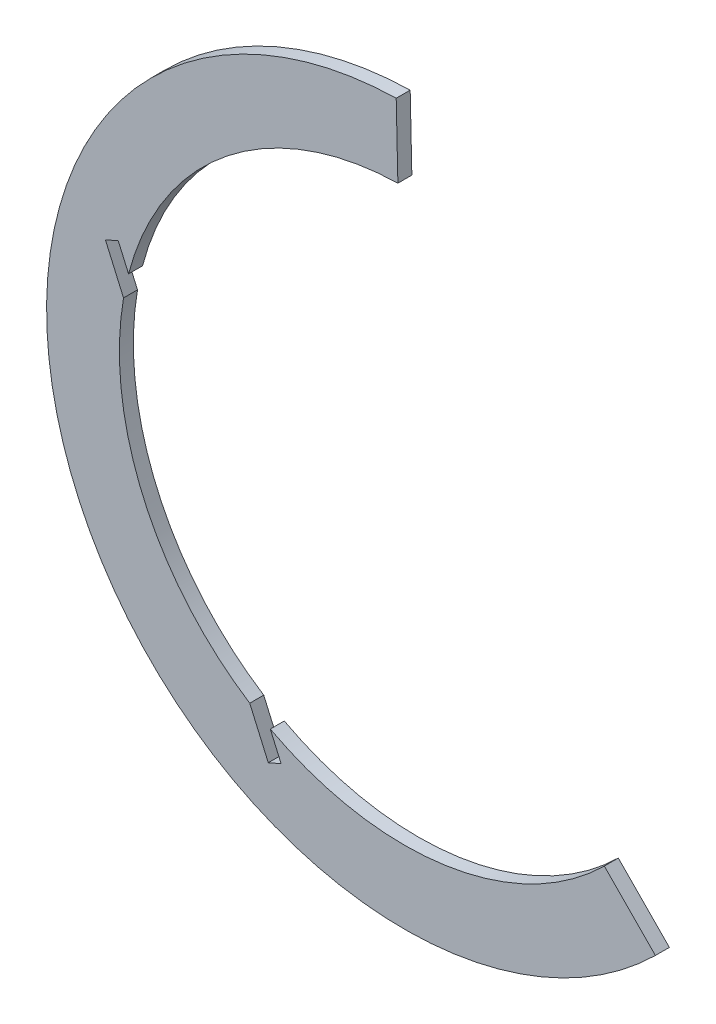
from build123d import *

# Parameters (mm, degrees)
BOSS_EXTRUDE1_DEPTH = 1.524


with BuildPart() as part:
    # Sketch1 → Boss-Extrude1 (new body)
    with BuildSketch(Plane.XY):
        with BuildLine():
            Line((-37.653044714, -57.173850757), (-32.085922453, -62.831682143))
            ThreePointArc((-32.085922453, -62.831682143), (-95.386360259, -50.219393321), (-60.347224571, 3.986457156))
            Line((-60.347224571, 3.986457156), (-60.164970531, -3.948950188))
            ThreePointArc((-60.164970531, -3.948950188), (-78.742187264, -10.652236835), (-89.529774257, -27.195362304))
            Line((-89.529774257, -27.195362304), (-90.655504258, -24.627908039))
            Line((-90.655504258, -24.627908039), (-92.051234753, -25.239882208))
            Line((-92.051234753, -25.239882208), (-90.078831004, -29.738346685))
            ThreePointArc((-90.078831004, -29.738346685), (-87.915106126, -47.500637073), (-76.316508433, -61.126098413))
            Line((-76.316508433, -61.126098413), (-74.294406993, -65.737908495))
            Line((-74.294406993, -65.737908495), (-72.898676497, -65.125934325))
            Line((-72.898676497, -65.125934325), (-74.074104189, -62.445134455))
            ThreePointArc((-74.074104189, -62.445134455), (-54.999524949, -65.779499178), (-37.653044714, -57.173850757))
        make_face()
    extrude(amount=BOSS_EXTRUDE1_DEPTH)


solid = part.part
